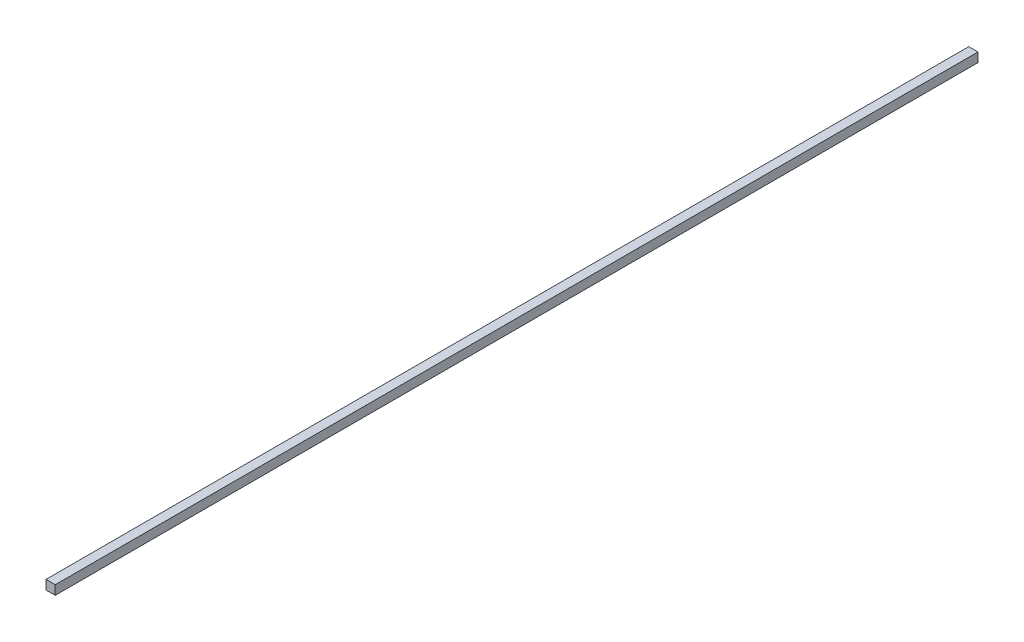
from build123d import *

# Parameters (mm, degrees)
ESQUISSE1_W      = 2
ESQUISSE1_H      = 2
EXTRUSION1_DEPTH = 100


with BuildPart() as part:
    # Esquisse1 → Extrusion1 (new, symmetric)
    with BuildSketch(Plane.XY):
        Rectangle(ESQUISSE1_W, ESQUISSE1_H)
    extrude(amount=EXTRUSION1_DEPTH, both=True)


solid = part.part
